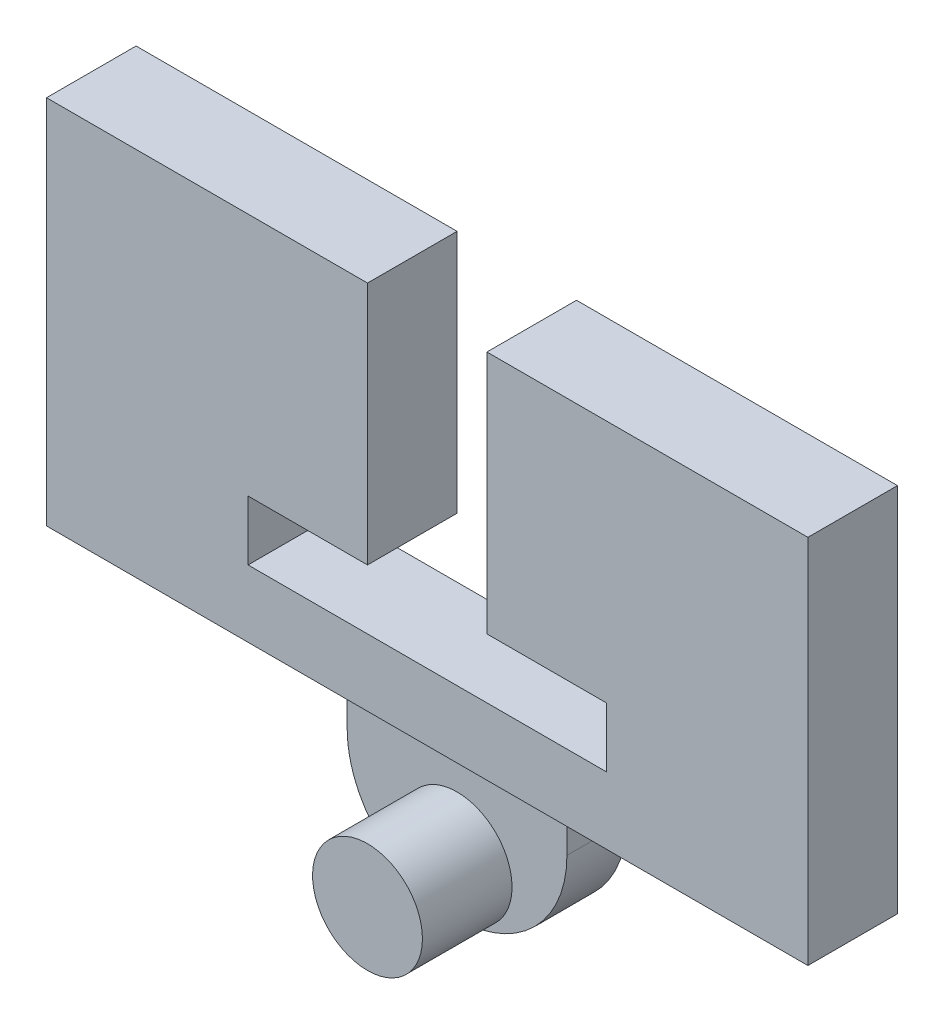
from build123d import *

# Parameters (mm, degrees)
SECTION_B_DEPTH = 12.7
SKETCH3_R       = 11.683201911
SECTION_A_DEPTH = 19.05
SKETCH4_W       = 161.925
SKETCH4_H       = 14.247035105
SECTION_C_DEPTH = 19.05
SKETCH5_W       = 42.8625
SKETCH5_H       = 12.7
SECTION_D_DEPTH = 19.05
SKETCH6_W       = 68.2625
SKETCH6_H       = 51.92422094
SECTION_E_DEPTH = 19.05


with BuildPart() as part:
    # Sketch1 → Section B (new body)
    with BuildSketch(Plane.XY):
        with BuildLine():
            Line((-23.366403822, 23.366403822), (-23.366403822, 35.049605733))
            Line((-23.366403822, 35.049605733), (23.366403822, 35.049605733))
            Line((23.366403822, 35.049605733), (23.366403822, 23.366403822))
            ThreePointArc((23.366403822, 23.366403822), (0, 0), (-23.366403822, 23.366403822))
        make_face()
    extrude(amount=SECTION_B_DEPTH)

    # Sketch3 → Section A (add)
    with BuildSketch(Plane.XY.offset(12.7)):
        with Locations(Location((0, 11.683201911, 0), (0, 0, 269.99966475))):
            Circle(SKETCH3_R)
    extrude(amount=SECTION_A_DEPTH)

    # Sketch4 → Section C (add)
    with BuildSketch(Plane.XY):
        with Locations((0, 42.173123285)):
            Rectangle(SKETCH4_W, SKETCH4_H)
    extrude(amount=SECTION_C_DEPTH)

    # Sketch5 → Section D (add)
    with BuildSketch(Plane.XY):
        with Locations((59.53125, 55.646640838)):
            Rectangle(SKETCH5_W, SKETCH5_H)
        with Locations((-59.53125, 55.646640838)):
            Rectangle(SKETCH5_W, SKETCH5_H)
    extrude(amount=SECTION_D_DEPTH)

    # Sketch6 → Section E (add)
    with BuildSketch(Plane.XY):
        with Locations((46.83125, 87.958751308)):
            Rectangle(SKETCH6_W, SKETCH6_H)
        with Locations((-46.83125, 87.958751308)):
            Rectangle(SKETCH6_W, SKETCH6_H)
    extrude(amount=SECTION_E_DEPTH)


solid = part.part
